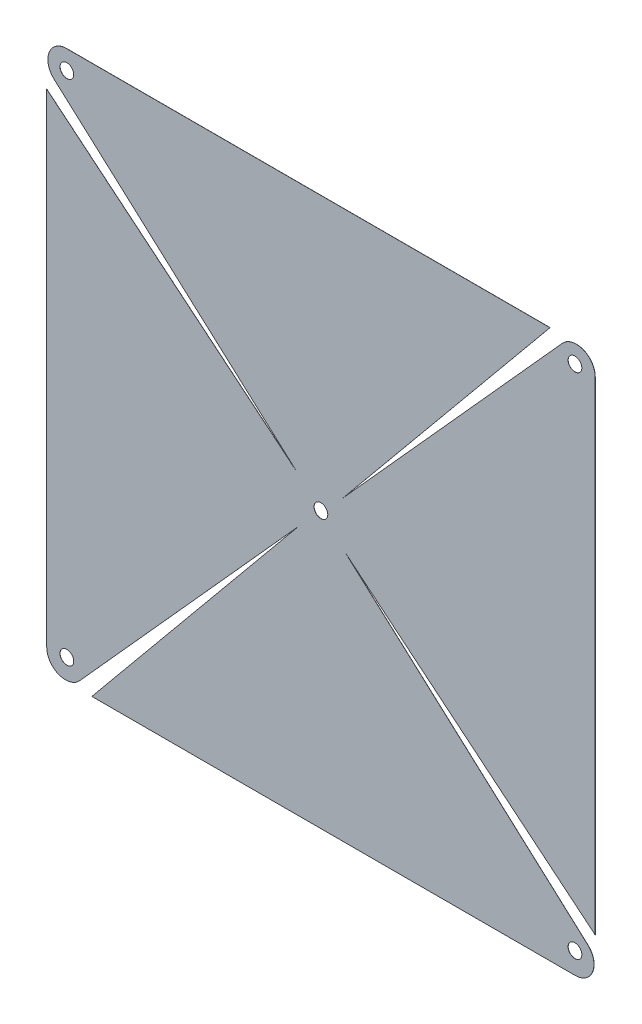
from build123d import *

# Parameters (mm, degrees)
SKETCH1_R           = 1.3890625
BOSS_EXTRUDE1_DEPTH = 0.0254
FILLET1_R           = 3.81


with BuildPart() as part:
    # Sketch1 → Boss-Extrude1 (new body)
    with BuildSketch(Plane.XY):
        Polygon((-4.718969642, 4.24897935), (-61.346605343, 55.236731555), (46.349121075, 55.236731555), (4.490128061, 4.490128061), (55.477880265, 61.117763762), (55.477880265, -46.577962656), (4.731276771, -4.718969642), (61.358912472, -55.706721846), (-46.336813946, -55.706721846), (-4.477820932, -4.960118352), (-55.465573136, -61.587754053), (-55.465573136, 46.107972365), align=None)
        Circle(SKETCH1_R, mode=Mode.SUBTRACT)
        with Locations((51.392099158, 51.392099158)):
            Circle(SKETCH1_R, mode=Mode.SUBTRACT)
        with Locations((51.392099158, -51.392099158)):
            Circle(SKETCH1_R, mode=Mode.SUBTRACT)
        with Locations((-51.392099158, -51.392099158)):
            Circle(SKETCH1_R, mode=Mode.SUBTRACT)
        with Locations((-51.392099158, 51.392099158)):
            Circle(SKETCH1_R, mode=Mode.SUBTRACT)
    extrude(amount=BOSS_EXTRUDE1_DEPTH)

    # Fillet1
    fillet1_edges = [part.edges().sort_by_distance(p)[0] for p in [
        (-61.346605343, 55.236731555, 0.0127),
        (55.477880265, 61.117763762, 0.0127),
        (61.358912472, -55.706721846, 0.0127),
        (-55.465573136, -61.587754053, 0.0127),
    ]]
    fillet(fillet1_edges, radius=FILLET1_R)


solid = part.part
